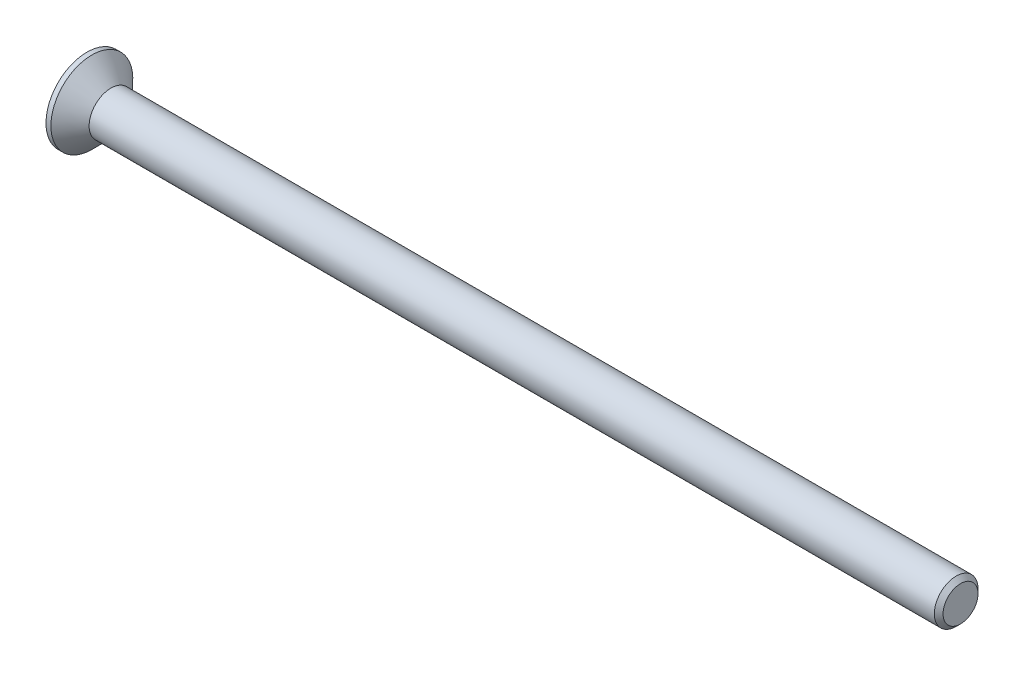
ISO-10303-21;
HEADER;
FILE_DESCRIPTION(('STEP AP214'),'2;1');
FILE_NAME('part.step','',(''),(''),'','','');
FILE_SCHEMA(('AUTOMOTIVE_DESIGN { 1 0 10303 214 1 1 1 1 }'));
ENDSEC;
DATA;
#1=APPLICATION_CONTEXT('core data for automotive mechanical design processes');
#2=APPLICATION_PROTOCOL_DEFINITION('international standard','automotive_design',2000,#1);
#3=PRODUCT_CONTEXT('',#1,'mechanical');
#4=PRODUCT('Part','Part','',(#3));
#5=PRODUCT_RELATED_PRODUCT_CATEGORY('part','',(#4));
#6=PRODUCT_DEFINITION_FORMATION('','',#4);
#7=PRODUCT_DEFINITION_CONTEXT('part definition',#1,'design');
#8=PRODUCT_DEFINITION('design','',#6,#7);
#9=PRODUCT_DEFINITION_SHAPE('','',#8);
#10=(LENGTH_UNIT() NAMED_UNIT(*) SI_UNIT(.MILLI.,.METRE.));
#11=(NAMED_UNIT(*) PLANE_ANGLE_UNIT() SI_UNIT($,.RADIAN.));
#12=(NAMED_UNIT(*) SI_UNIT($,.STERADIAN.) SOLID_ANGLE_UNIT());
#13=UNCERTAINTY_MEASURE_WITH_UNIT(LENGTH_MEASURE(1.E-05),#10,'distance_accuracy_value','');
#14=(GEOMETRIC_REPRESENTATION_CONTEXT(3) GLOBAL_UNCERTAINTY_ASSIGNED_CONTEXT((#13)) GLOBAL_UNIT_ASSIGNED_CONTEXT((#10,
#11,#12)) REPRESENTATION_CONTEXT('',''));
#15=CARTESIAN_POINT('',(0.,0.,0.));
#16=DIRECTION('',(0.,0.,1.));
#17=DIRECTION('',(1.,0.,0.));
#18=AXIS2_PLACEMENT_3D('',#15,#16,#17);
#19=CARTESIAN_POINT('',(0.,0.,0.));
#20=DIRECTION('',(-1.,0.,0.));
#21=DIRECTION('',(0.,-1.,0.));
#22=AXIS2_PLACEMENT_3D('',#19,#20,#21);
#23=CONICAL_SURFACE('',#22,2.,0.78539816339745);
#24=CARTESIAN_POINT('',(-1.74999999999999,0.,0.));
#25=DIRECTION('',(-1.,0.,0.));
#26=DIRECTION('',(0.,-1.,0.));
#27=AXIS2_PLACEMENT_3D('',#24,#25,#26);
#28=CIRCLE('',#27,3.75);
#29=CARTESIAN_POINT('',(-1.74999999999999,-3.75,0.));
#30=VERTEX_POINT('',#29);
#31=EDGE_CURVE('E189',#30,#30,#28,.T.);
#32=ORIENTED_EDGE('',*,*,#31,.F.);
#33=EDGE_LOOP('',(#32));
#34=FACE_BOUND('',#33,.T.);
#35=CARTESIAN_POINT('',(0.,0.,0.));
#36=DIRECTION('',(-1.,0.,0.));
#37=DIRECTION('',(0.,-1.,0.));
#38=AXIS2_PLACEMENT_3D('',#35,#36,#37);
#39=CIRCLE('',#38,2.);
#40=CARTESIAN_POINT('',(0.,-2.,0.));
#41=VERTEX_POINT('',#40);
#42=EDGE_CURVE('E212',#41,#41,#39,.T.);
#43=ORIENTED_EDGE('',*,*,#42,.T.);
#44=EDGE_LOOP('',(#43));
#45=FACE_BOUND('',#44,.T.);
#46=ADVANCED_FACE('F33',(#34,#45),#23,.T.);
#47=CARTESIAN_POINT('',(-2.2,0.,0.));
#48=DIRECTION('',(-1.,0.,0.));
#49=DIRECTION('',(0.,-1.,0.));
#50=AXIS2_PLACEMENT_3D('',#47,#48,#49);
#51=CYLINDRICAL_SURFACE('',#50,2.);
#52=CARTESIAN_POINT('',(77.4,0.,0.));
#53=DIRECTION('',(-1.,0.,0.));
#54=DIRECTION('',(0.,-1.,0.));
#55=AXIS2_PLACEMENT_3D('',#52,#53,#54);
#56=CIRCLE('',#55,2.);
#57=CARTESIAN_POINT('',(77.4,-2.,0.));
#58=VERTEX_POINT('',#57);
#59=EDGE_CURVE('E41',#58,#58,#56,.T.);
#60=ORIENTED_EDGE('',*,*,#59,.T.);
#61=EDGE_LOOP('',(#60));
#62=FACE_BOUND('',#61,.T.);
#63=ORIENTED_EDGE('',*,*,#42,.F.);
#64=EDGE_LOOP('',(#63));
#65=FACE_BOUND('',#64,.T.);
#66=ADVANCED_FACE('F217',(#62,#65),#51,.T.);
#67=CARTESIAN_POINT('',(77.8,0.,0.));
#68=DIRECTION('',(-1.,0.,0.));
#69=DIRECTION('',(0.,-1.,0.));
#70=AXIS2_PLACEMENT_3D('',#67,#68,#69);
#71=PLANE('',#70);
#72=CARTESIAN_POINT('',(77.8,0.,0.));
#73=DIRECTION('',(-1.,0.,0.));
#74=DIRECTION('',(0.,-1.,0.));
#75=AXIS2_PLACEMENT_3D('',#72,#73,#74);
#76=CIRCLE('',#75,1.59999999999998);
#77=CARTESIAN_POINT('',(77.8,-1.59999999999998,0.));
#78=VERTEX_POINT('',#77);
#79=EDGE_CURVE('E11',#78,#78,#76,.F.);
#80=ORIENTED_EDGE('',*,*,#79,.T.);
#81=EDGE_LOOP('',(#80));
#82=FACE_BOUND('',#81,.T.);
#83=ADVANCED_FACE('F239',(#82),#71,.F.);
#84=CARTESIAN_POINT('',(-2.2,3.75,0.));
#85=DIRECTION('',(1.,0.,0.));
#86=DIRECTION('',(0.,1.,0.));
#87=AXIS2_PLACEMENT_3D('',#84,#85,#86);
#88=PLANE('',#87);
#89=DIRECTION('',(0.,0.,-1.));
#90=VECTOR('',#89,1.);
#91=CARTESIAN_POINT('',(-2.2,0.55,-2.2));
#92=LINE('',#91,#90);
#93=CARTESIAN_POINT('',(-2.2,0.55,-0.55));
#94=VERTEX_POINT('',#93);
#95=CARTESIAN_POINT('',(-2.2,0.55,-2.2));
#96=VERTEX_POINT('',#95);
#97=EDGE_CURVE('E158',#94,#96,#92,.T.);
#98=ORIENTED_EDGE('',*,*,#97,.F.);
#99=DIRECTION('',(0.,-1.,0.));
#100=VECTOR('',#99,1.);
#101=CARTESIAN_POINT('',(-2.2,0.55,-0.55));
#102=LINE('',#101,#100);
#103=CARTESIAN_POINT('',(-2.2,2.2,-0.55));
#104=VERTEX_POINT('',#103);
#105=EDGE_CURVE('E48',#104,#94,#102,.T.);
#106=ORIENTED_EDGE('',*,*,#105,.F.);
#107=DIRECTION('',(0.,0.,-1.));
#108=VECTOR('',#107,1.);
#109=CARTESIAN_POINT('',(-2.2,2.2,-0.55));
#110=LINE('',#109,#108);
#111=CARTESIAN_POINT('',(-2.2,2.2,0.55));
#112=VERTEX_POINT('',#111);
#113=EDGE_CURVE('E185',#112,#104,#110,.T.);
#114=ORIENTED_EDGE('',*,*,#113,.F.);
#115=DIRECTION('',(0.,1.,0.));
#116=VECTOR('',#115,1.);
#117=CARTESIAN_POINT('',(-2.2,2.2,0.55));
#118=LINE('',#117,#116);
#119=CARTESIAN_POINT('',(-2.2,0.55,0.55));
#120=VERTEX_POINT('',#119);
#121=EDGE_CURVE('E183',#120,#112,#118,.T.);
#122=ORIENTED_EDGE('',*,*,#121,.F.);
#123=DIRECTION('',(0.,0.,-1.));
#124=VECTOR('',#123,1.);
#125=CARTESIAN_POINT('',(-2.2,0.55,0.55));
#126=LINE('',#125,#124);
#127=CARTESIAN_POINT('',(-2.2,0.55,2.2));
#128=VERTEX_POINT('',#127);
#129=EDGE_CURVE('E132',#128,#120,#126,.T.);
#130=ORIENTED_EDGE('',*,*,#129,.F.);
#131=DIRECTION('',(0.,1.,0.));
#132=VECTOR('',#131,1.);
#133=CARTESIAN_POINT('',(-2.2,0.55,2.2));
#134=LINE('',#133,#132);
#135=CARTESIAN_POINT('',(-2.2,-0.55,2.2));
#136=VERTEX_POINT('',#135);
#137=EDGE_CURVE('E179',#136,#128,#134,.T.);
#138=ORIENTED_EDGE('',*,*,#137,.F.);
#139=DIRECTION('',(0.,0.,1.));
#140=VECTOR('',#139,1.);
#141=CARTESIAN_POINT('',(-2.2,-0.55,2.2));
#142=LINE('',#141,#140);
#143=CARTESIAN_POINT('',(-2.2,-0.55,0.55));
#144=VERTEX_POINT('',#143);
#145=EDGE_CURVE('E176',#144,#136,#142,.T.);
#146=ORIENTED_EDGE('',*,*,#145,.F.);
#147=DIRECTION('',(0.,1.,0.));
#148=VECTOR('',#147,1.);
#149=CARTESIAN_POINT('',(-2.2,-0.55,0.55));
#150=LINE('',#149,#148);
#151=CARTESIAN_POINT('',(-2.2,-2.2,0.55));
#152=VERTEX_POINT('',#151);
#153=EDGE_CURVE('E173',#152,#144,#150,.T.);
#154=ORIENTED_EDGE('',*,*,#153,.F.);
#155=DIRECTION('',(0.,0.,1.));
#156=VECTOR('',#155,1.);
#157=CARTESIAN_POINT('',(-2.2,-2.2,0.55));
#158=LINE('',#157,#156);
#159=CARTESIAN_POINT('',(-2.2,-2.2,-0.55));
#160=VERTEX_POINT('',#159);
#161=EDGE_CURVE('E170',#160,#152,#158,.T.);
#162=ORIENTED_EDGE('',*,*,#161,.F.);
#163=DIRECTION('',(0.,-1.,0.));
#164=VECTOR('',#163,1.);
#165=CARTESIAN_POINT('',(-2.2,-2.2,-0.55));
#166=LINE('',#165,#164);
#167=CARTESIAN_POINT('',(-2.2,-0.55,-0.55));
#168=VERTEX_POINT('',#167);
#169=EDGE_CURVE('E167',#168,#160,#166,.T.);
#170=ORIENTED_EDGE('',*,*,#169,.F.);
#171=DIRECTION('',(0.,0.,1.));
#172=VECTOR('',#171,1.);
#173=CARTESIAN_POINT('',(-2.2,-0.55,-0.55));
#174=LINE('',#173,#172);
#175=CARTESIAN_POINT('',(-2.2,-0.55,-2.2));
#176=VERTEX_POINT('',#175);
#177=EDGE_CURVE('E164',#176,#168,#174,.T.);
#178=ORIENTED_EDGE('',*,*,#177,.F.);
#179=DIRECTION('',(0.,-1.,0.));
#180=VECTOR('',#179,1.);
#181=CARTESIAN_POINT('',(-2.2,-0.55,-2.2));
#182=LINE('',#181,#180);
#183=EDGE_CURVE('E161',#96,#176,#182,.T.);
#184=ORIENTED_EDGE('',*,*,#183,.F.);
#185=EDGE_LOOP('',(#98,#106,#114,#122,#130,#138,#146,#154,#162,#170,#178,#184));
#186=FACE_BOUND('',#185,.T.);
#187=CARTESIAN_POINT('',(-2.2,0.,0.));
#188=DIRECTION('',(-1.,0.,0.));
#189=DIRECTION('',(0.,-1.,0.));
#190=AXIS2_PLACEMENT_3D('',#187,#188,#189);
#191=CIRCLE('',#190,3.75);
#192=CARTESIAN_POINT('',(-2.2,-3.75,0.));
#193=VERTEX_POINT('',#192);
#194=EDGE_CURVE('E209',#193,#193,#191,.T.);
#195=ORIENTED_EDGE('',*,*,#194,.T.);
#196=EDGE_LOOP('',(#195));
#197=FACE_BOUND('',#196,.T.);
#198=ADVANCED_FACE('F230',(#186,#197),#88,.F.);
#199=CARTESIAN_POINT('',(-2.2,0.,0.));
#200=DIRECTION('',(-1.,0.,0.));
#201=DIRECTION('',(0.,-1.,0.));
#202=AXIS2_PLACEMENT_3D('',#199,#200,#201);
#203=CYLINDRICAL_SURFACE('',#202,3.75);
#204=ORIENTED_EDGE('',*,*,#194,.F.);
#205=EDGE_LOOP('',(#204));
#206=FACE_BOUND('',#205,.T.);
#207=ORIENTED_EDGE('',*,*,#31,.T.);
#208=EDGE_LOOP('',(#207));
#209=FACE_BOUND('',#208,.T.);
#210=ADVANCED_FACE('F222',(#206,#209),#203,.T.);
#211=CARTESIAN_POINT('',(77.4,0.,0.));
#212=DIRECTION('',(-1.,0.,0.));
#213=DIRECTION('',(0.,-1.,0.));
#214=AXIS2_PLACEMENT_3D('',#211,#212,#213);
#215=CONICAL_SURFACE('',#214,2.,0.785398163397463);
#216=ORIENTED_EDGE('',*,*,#79,.F.);
#217=EDGE_LOOP('',(#216));
#218=FACE_BOUND('',#217,.T.);
#219=ORIENTED_EDGE('',*,*,#59,.F.);
#220=EDGE_LOOP('',(#219));
#221=FACE_BOUND('',#220,.T.);
#222=ADVANCED_FACE('F35',(#218,#221),#215,.T.);
#223=CARTESIAN_POINT('',(-0.3,0.55,-0.55));
#224=DIRECTION('',(0.,0.,-1.));
#225=DIRECTION('',(-1.,0.,0.));
#226=AXIS2_PLACEMENT_3D('',#223,#224,#225);
#227=PLANE('',#226);
#228=ORIENTED_EDGE('',*,*,#105,.T.);
#229=DIRECTION('',(-1.,0.,0.));
#230=VECTOR('',#229,1.);
#231=CARTESIAN_POINT('',(-0.3,0.55,-0.55));
#232=LINE('',#231,#230);
#233=CARTESIAN_POINT('',(-0.3,0.55,-0.55));
#234=VERTEX_POINT('',#233);
#235=EDGE_CURVE('E96',#234,#94,#232,.T.);
#236=ORIENTED_EDGE('',*,*,#235,.F.);
#237=DIRECTION('',(0.,-1.,0.));
#238=VECTOR('',#237,1.);
#239=CARTESIAN_POINT('',(-0.3,0.55,-0.55));
#240=LINE('',#239,#238);
#241=CARTESIAN_POINT('',(-0.3,2.2,-0.55));
#242=VERTEX_POINT('',#241);
#243=EDGE_CURVE('E187',#242,#234,#240,.T.);
#244=ORIENTED_EDGE('',*,*,#243,.F.);
#245=DIRECTION('',(-1.,0.,0.));
#246=VECTOR('',#245,1.);
#247=CARTESIAN_POINT('',(-0.3,2.2,-0.55));
#248=LINE('',#247,#246);
#249=EDGE_CURVE('E56',#242,#104,#248,.T.);
#250=ORIENTED_EDGE('',*,*,#249,.T.);
#251=EDGE_LOOP('',(#228,#236,#244,#250));
#252=FACE_BOUND('',#251,.T.);
#253=ADVANCED_FACE('F221',(#252),#227,.F.);
#254=CARTESIAN_POINT('',(-0.3,2.2,-0.55));
#255=DIRECTION('',(0.,1.,0.));
#256=DIRECTION('',(-1.,0.,0.));
#257=AXIS2_PLACEMENT_3D('',#254,#255,#256);
#258=PLANE('',#257);
#259=ORIENTED_EDGE('',*,*,#113,.T.);
#260=ORIENTED_EDGE('',*,*,#249,.F.);
#261=DIRECTION('',(0.,0.,-1.));
#262=VECTOR('',#261,1.);
#263=CARTESIAN_POINT('',(-0.3,2.2,-0.55));
#264=LINE('',#263,#262);
#265=CARTESIAN_POINT('',(-0.3,2.2,0.55));
#266=VERTEX_POINT('',#265);
#267=EDGE_CURVE('E144',#266,#242,#264,.T.);
#268=ORIENTED_EDGE('',*,*,#267,.F.);
#269=DIRECTION('',(-1.,0.,0.));
#270=VECTOR('',#269,1.);
#271=CARTESIAN_POINT('',(-0.3,2.2,0.55));
#272=LINE('',#271,#270);
#273=EDGE_CURVE('E136',#266,#112,#272,.T.);
#274=ORIENTED_EDGE('',*,*,#273,.T.);
#275=EDGE_LOOP('',(#259,#260,#268,#274));
#276=FACE_BOUND('',#275,.T.);
#277=ADVANCED_FACE('F228',(#276),#258,.F.);
#278=CARTESIAN_POINT('',(-0.3,2.2,0.55));
#279=DIRECTION('',(0.,0.,1.));
#280=DIRECTION('',(1.,0.,0.));
#281=AXIS2_PLACEMENT_3D('',#278,#279,#280);
#282=PLANE('',#281);
#283=ORIENTED_EDGE('',*,*,#121,.T.);
#284=ORIENTED_EDGE('',*,*,#273,.F.);
#285=DIRECTION('',(0.,1.,0.));
#286=VECTOR('',#285,1.);
#287=CARTESIAN_POINT('',(-0.3,2.2,0.55));
#288=LINE('',#287,#286);
#289=CARTESIAN_POINT('',(-0.3,0.55,0.55));
#290=VERTEX_POINT('',#289);
#291=EDGE_CURVE('E140',#290,#266,#288,.T.);
#292=ORIENTED_EDGE('',*,*,#291,.F.);
#293=DIRECTION('',(-1.,0.,0.));
#294=VECTOR('',#293,1.);
#295=CARTESIAN_POINT('',(-0.3,0.55,0.55));
#296=LINE('',#295,#294);
#297=EDGE_CURVE('E125',#290,#120,#296,.T.);
#298=ORIENTED_EDGE('',*,*,#297,.T.);
#299=EDGE_LOOP('',(#283,#284,#292,#298));
#300=FACE_BOUND('',#299,.T.);
#301=ADVANCED_FACE('F141',(#300),#282,.F.);
#302=CARTESIAN_POINT('',(-0.3,0.55,0.55));
#303=DIRECTION('',(0.,1.,0.));
#304=DIRECTION('',(-1.,0.,0.));
#305=AXIS2_PLACEMENT_3D('',#302,#303,#304);
#306=PLANE('',#305);
#307=ORIENTED_EDGE('',*,*,#129,.T.);
#308=ORIENTED_EDGE('',*,*,#297,.F.);
#309=DIRECTION('',(0.,0.,-1.));
#310=VECTOR('',#309,1.);
#311=CARTESIAN_POINT('',(-0.3,0.55,0.55));
#312=LINE('',#311,#310);
#313=CARTESIAN_POINT('',(-0.3,0.55,2.2));
#314=VERTEX_POINT('',#313);
#315=EDGE_CURVE('E129',#314,#290,#312,.T.);
#316=ORIENTED_EDGE('',*,*,#315,.F.);
#317=DIRECTION('',(-1.,0.,0.));
#318=VECTOR('',#317,1.);
#319=CARTESIAN_POINT('',(-0.3,0.55,2.2));
#320=LINE('',#319,#318);
#321=EDGE_CURVE('E137',#314,#128,#320,.T.);
#322=ORIENTED_EDGE('',*,*,#321,.T.);
#323=EDGE_LOOP('',(#307,#308,#316,#322));
#324=FACE_BOUND('',#323,.T.);
#325=ADVANCED_FACE('F127',(#324),#306,.F.);
#326=CARTESIAN_POINT('',(-0.3,0.55,2.2));
#327=DIRECTION('',(0.,0.,1.));
#328=DIRECTION('',(1.,0.,0.));
#329=AXIS2_PLACEMENT_3D('',#326,#327,#328);
#330=PLANE('',#329);
#331=ORIENTED_EDGE('',*,*,#137,.T.);
#332=ORIENTED_EDGE('',*,*,#321,.F.);
#333=DIRECTION('',(0.,1.,0.));
#334=VECTOR('',#333,1.);
#335=CARTESIAN_POINT('',(-0.3,0.55,2.2));
#336=LINE('',#335,#334);
#337=CARTESIAN_POINT('',(-0.3,-0.55,2.2));
#338=VERTEX_POINT('',#337);
#339=EDGE_CURVE('E150',#338,#314,#336,.T.);
#340=ORIENTED_EDGE('',*,*,#339,.F.);
#341=DIRECTION('',(-1.,0.,0.));
#342=VECTOR('',#341,1.);
#343=CARTESIAN_POINT('',(-0.3,-0.55,2.2));
#344=LINE('',#343,#342);
#345=EDGE_CURVE('E192',#338,#136,#344,.T.);
#346=ORIENTED_EDGE('',*,*,#345,.T.);
#347=EDGE_LOOP('',(#331,#332,#340,#346));
#348=FACE_BOUND('',#347,.T.);
#349=ADVANCED_FACE('F277',(#348),#330,.F.);
#350=CARTESIAN_POINT('',(-0.3,-0.55,2.2));
#351=DIRECTION('',(0.,-1.,0.));
#352=DIRECTION('',(1.,0.,0.));
#353=AXIS2_PLACEMENT_3D('',#350,#351,#352);
#354=PLANE('',#353);
#355=ORIENTED_EDGE('',*,*,#145,.T.);
#356=ORIENTED_EDGE('',*,*,#345,.F.);
#357=DIRECTION('',(0.,0.,1.));
#358=VECTOR('',#357,1.);
#359=CARTESIAN_POINT('',(-0.3,-0.55,2.2));
#360=LINE('',#359,#358);
#361=CARTESIAN_POINT('',(-0.3,-0.55,0.55));
#362=VERTEX_POINT('',#361);
#363=EDGE_CURVE('E152',#362,#338,#360,.T.);
#364=ORIENTED_EDGE('',*,*,#363,.F.);
#365=DIRECTION('',(-1.,0.,0.));
#366=VECTOR('',#365,1.);
#367=CARTESIAN_POINT('',(-0.3,-0.55,0.55));
#368=LINE('',#367,#366);
#369=EDGE_CURVE('E194',#362,#144,#368,.T.);
#370=ORIENTED_EDGE('',*,*,#369,.T.);
#371=EDGE_LOOP('',(#355,#356,#364,#370));
#372=FACE_BOUND('',#371,.T.);
#373=ADVANCED_FACE('F273',(#372),#354,.F.);
#374=CARTESIAN_POINT('',(-0.3,-0.55,0.55));
#375=DIRECTION('',(0.,0.,1.));
#376=DIRECTION('',(1.,0.,0.));
#377=AXIS2_PLACEMENT_3D('',#374,#375,#376);
#378=PLANE('',#377);
#379=ORIENTED_EDGE('',*,*,#153,.T.);
#380=ORIENTED_EDGE('',*,*,#369,.F.);
#381=DIRECTION('',(0.,1.,0.));
#382=VECTOR('',#381,1.);
#383=CARTESIAN_POINT('',(-0.3,-0.55,0.55));
#384=LINE('',#383,#382);
#385=CARTESIAN_POINT('',(-0.3,-2.2,0.55));
#386=VERTEX_POINT('',#385);
#387=EDGE_CURVE('E422',#386,#362,#384,.T.);
#388=ORIENTED_EDGE('',*,*,#387,.F.);
#389=DIRECTION('',(-1.,0.,0.));
#390=VECTOR('',#389,1.);
#391=CARTESIAN_POINT('',(-0.3,-2.2,0.55));
#392=LINE('',#391,#390);
#393=EDGE_CURVE('E196',#386,#152,#392,.T.);
#394=ORIENTED_EDGE('',*,*,#393,.T.);
#395=EDGE_LOOP('',(#379,#380,#388,#394));
#396=FACE_BOUND('',#395,.T.);
#397=ADVANCED_FACE('F269',(#396),#378,.F.);
#398=CARTESIAN_POINT('',(-0.3,-2.2,0.55));
#399=DIRECTION('',(0.,-1.,0.));
#400=DIRECTION('',(1.,0.,0.));
#401=AXIS2_PLACEMENT_3D('',#398,#399,#400);
#402=PLANE('',#401);
#403=ORIENTED_EDGE('',*,*,#161,.T.);
#404=ORIENTED_EDGE('',*,*,#393,.F.);
#405=DIRECTION('',(0.,0.,1.));
#406=VECTOR('',#405,1.);
#407=CARTESIAN_POINT('',(-0.3,-2.2,0.55));
#408=LINE('',#407,#406);
#409=CARTESIAN_POINT('',(-0.3,-2.2,-0.55));
#410=VERTEX_POINT('',#409);
#411=EDGE_CURVE('E419',#410,#386,#408,.T.);
#412=ORIENTED_EDGE('',*,*,#411,.F.);
#413=DIRECTION('',(-1.,0.,0.));
#414=VECTOR('',#413,1.);
#415=CARTESIAN_POINT('',(-0.3,-2.2,-0.55));
#416=LINE('',#415,#414);
#417=EDGE_CURVE('E198',#410,#160,#416,.T.);
#418=ORIENTED_EDGE('',*,*,#417,.T.);
#419=EDGE_LOOP('',(#403,#404,#412,#418));
#420=FACE_BOUND('',#419,.T.);
#421=ADVANCED_FACE('F265',(#420),#402,.F.);
#422=CARTESIAN_POINT('',(-0.3,-2.2,-0.55));
#423=DIRECTION('',(0.,0.,-1.));
#424=DIRECTION('',(-1.,0.,0.));
#425=AXIS2_PLACEMENT_3D('',#422,#423,#424);
#426=PLANE('',#425);
#427=ORIENTED_EDGE('',*,*,#169,.T.);
#428=ORIENTED_EDGE('',*,*,#417,.F.);
#429=DIRECTION('',(0.,-1.,0.));
#430=VECTOR('',#429,1.);
#431=CARTESIAN_POINT('',(-0.3,-2.2,-0.55));
#432=LINE('',#431,#430);
#433=CARTESIAN_POINT('',(-0.3,-0.55,-0.55));
#434=VERTEX_POINT('',#433);
#435=EDGE_CURVE('E416',#434,#410,#432,.T.);
#436=ORIENTED_EDGE('',*,*,#435,.F.);
#437=DIRECTION('',(-1.,0.,0.));
#438=VECTOR('',#437,1.);
#439=CARTESIAN_POINT('',(-0.3,-0.55,-0.55));
#440=LINE('',#439,#438);
#441=EDGE_CURVE('E200',#434,#168,#440,.T.);
#442=ORIENTED_EDGE('',*,*,#441,.T.);
#443=EDGE_LOOP('',(#427,#428,#436,#442));
#444=FACE_BOUND('',#443,.T.);
#445=ADVANCED_FACE('F261',(#444),#426,.F.);
#446=CARTESIAN_POINT('',(-0.3,-0.55,-0.55));
#447=DIRECTION('',(0.,-1.,0.));
#448=DIRECTION('',(1.,0.,0.));
#449=AXIS2_PLACEMENT_3D('',#446,#447,#448);
#450=PLANE('',#449);
#451=ORIENTED_EDGE('',*,*,#177,.T.);
#452=ORIENTED_EDGE('',*,*,#441,.F.);
#453=DIRECTION('',(0.,0.,1.));
#454=VECTOR('',#453,1.);
#455=CARTESIAN_POINT('',(-0.3,-0.55,-0.55));
#456=LINE('',#455,#454);
#457=CARTESIAN_POINT('',(-0.3,-0.55,-2.2));
#458=VERTEX_POINT('',#457);
#459=EDGE_CURVE('E413',#458,#434,#456,.T.);
#460=ORIENTED_EDGE('',*,*,#459,.F.);
#461=DIRECTION('',(-1.,0.,0.));
#462=VECTOR('',#461,1.);
#463=CARTESIAN_POINT('',(-0.3,-0.55,-2.2));
#464=LINE('',#463,#462);
#465=EDGE_CURVE('E202',#458,#176,#464,.T.);
#466=ORIENTED_EDGE('',*,*,#465,.T.);
#467=EDGE_LOOP('',(#451,#452,#460,#466));
#468=FACE_BOUND('',#467,.T.);
#469=ADVANCED_FACE('F257',(#468),#450,.F.);
#470=CARTESIAN_POINT('',(-0.3,-0.55,-2.2));
#471=DIRECTION('',(0.,0.,-1.));
#472=DIRECTION('',(-1.,0.,0.));
#473=AXIS2_PLACEMENT_3D('',#470,#471,#472);
#474=PLANE('',#473);
#475=ORIENTED_EDGE('',*,*,#183,.T.);
#476=ORIENTED_EDGE('',*,*,#465,.F.);
#477=DIRECTION('',(0.,-1.,0.));
#478=VECTOR('',#477,1.);
#479=CARTESIAN_POINT('',(-0.3,-0.55,-2.2));
#480=LINE('',#479,#478);
#481=CARTESIAN_POINT('',(-0.3,0.55,-2.2));
#482=VERTEX_POINT('',#481);
#483=EDGE_CURVE('E408',#482,#458,#480,.T.);
#484=ORIENTED_EDGE('',*,*,#483,.F.);
#485=DIRECTION('',(-1.,0.,0.));
#486=VECTOR('',#485,1.);
#487=CARTESIAN_POINT('',(-0.3,0.55,-2.2));
#488=LINE('',#487,#486);
#489=EDGE_CURVE('E204',#482,#96,#488,.T.);
#490=ORIENTED_EDGE('',*,*,#489,.T.);
#491=EDGE_LOOP('',(#475,#476,#484,#490));
#492=FACE_BOUND('',#491,.T.);
#493=ADVANCED_FACE('F253',(#492),#474,.F.);
#494=CARTESIAN_POINT('',(-0.3,0.55,-2.2));
#495=DIRECTION('',(0.,1.,0.));
#496=DIRECTION('',(-1.,0.,0.));
#497=AXIS2_PLACEMENT_3D('',#494,#495,#496);
#498=PLANE('',#497);
#499=ORIENTED_EDGE('',*,*,#97,.T.);
#500=ORIENTED_EDGE('',*,*,#489,.F.);
#501=DIRECTION('',(0.,0.,-1.));
#502=VECTOR('',#501,1.);
#503=CARTESIAN_POINT('',(-0.3,0.55,-2.2));
#504=LINE('',#503,#502);
#505=EDGE_CURVE('E406',#234,#482,#504,.T.);
#506=ORIENTED_EDGE('',*,*,#505,.F.);
#507=ORIENTED_EDGE('',*,*,#235,.T.);
#508=EDGE_LOOP('',(#499,#500,#506,#507));
#509=FACE_BOUND('',#508,.T.);
#510=ADVANCED_FACE('F250',(#509),#498,.F.);
#511=CARTESIAN_POINT('',(-0.3,0.,0.));
#512=DIRECTION('',(1.,0.,0.));
#513=DIRECTION('',(0.,0.,-1.));
#514=AXIS2_PLACEMENT_3D('',#511,#512,#513);
#515=PLANE('',#514);
#516=ORIENTED_EDGE('',*,*,#243,.T.);
#517=ORIENTED_EDGE('',*,*,#505,.T.);
#518=ORIENTED_EDGE('',*,*,#483,.T.);
#519=ORIENTED_EDGE('',*,*,#459,.T.);
#520=ORIENTED_EDGE('',*,*,#435,.T.);
#521=ORIENTED_EDGE('',*,*,#411,.T.);
#522=ORIENTED_EDGE('',*,*,#387,.T.);
#523=ORIENTED_EDGE('',*,*,#363,.T.);
#524=ORIENTED_EDGE('',*,*,#339,.T.);
#525=ORIENTED_EDGE('',*,*,#315,.T.);
#526=ORIENTED_EDGE('',*,*,#291,.T.);
#527=ORIENTED_EDGE('',*,*,#267,.T.);
#528=EDGE_LOOP('',(#516,#517,#518,#519,#520,#521,#522,#523,#524,#525,#526,#527));
#529=FACE_BOUND('',#528,.T.);
#530=ADVANCED_FACE('F147',(#529),#515,.F.);
#531=CLOSED_SHELL('',(#46,#66,#83,#198,#210,#222,#253,#277,#301,#325,#349,#373,#397,#421,#445,
#469,#493,#510,#530));
#532=MANIFOLD_SOLID_BREP('B2',#531);
#533=ADVANCED_BREP_SHAPE_REPRESENTATION('',(#18,#532),#14);
#534=SHAPE_DEFINITION_REPRESENTATION(#9,#533);
ENDSEC;
END-ISO-10303-21;
